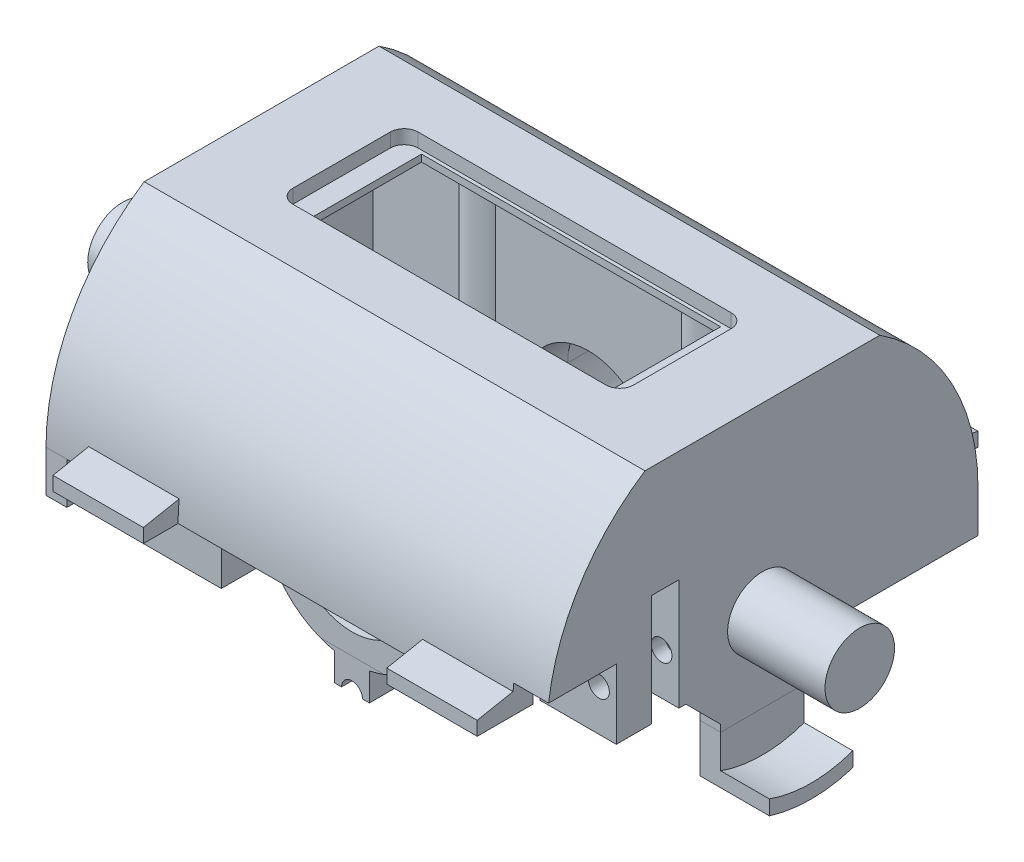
from build123d import *
from build123d.topology import SkipClean

# Parameters (mm, degrees)
BOSS_EXTRUDE1_DEPTH      = 33
BOSS_EXTRUDE2_DEPTH      = 1.5
BOSS_EXTRUDE3_START      = 1.5
BOSS_EXTRUDE3_DEPTH      = 1.5
SKETCH4_R                = 3.5
BOSS_EXTRUDE5_DEPTH      = 8
CUT_EXTRUDE1_DEPTH       = 1
SKETCH6_W                = 21.5
SKETCH6_H                = 8.5
CUT_EXTRUDE2_DEPTH       = 0.5
SKETCH7_R                = 2.5
BOSS_EXTRUDE6_DEPTH      = 3.5
BOSS_EXTRUDE7_DEPTH      = 3.5
BOSS_EXTRUDE8_START      = 7
SKETCH9_R                = 2.5
BOSS_EXTRUDE8_DEPTH      = 7
BOSS_EXTRUDE9_START      = 9
BOSS_EXTRUDE9_DEPTH      = 6.5
BOSS_EXTRUDE10_START     = -15
BOSS_EXTRUDE10_DEPTH     = 6.5
BOSS_EXTRUDE11_REACH     = 62.431
SKETCH12_R               = 1
SKETCH12_W               = 4
SKETCH12_H               = 1
BOSS_EXTRUDE13_START     = 6
SKETCH17_R               = 1
BOSS_EXTRUDE13_DEPTH     = 6
CUT_EXTRUDE3_REACH       = 55.047
CUT_EXTRUDE4_REACH       = 53.613
BOSS_EXTRUDE12_START     = 10
SKETCH15_R               = 1
BOSS_EXTRUDE12_DEPTH     = 10
SKETCH16_R               = 4.5
CUT_EXTRUDE5_DEPTH       = 6
CUT_EXTRUDE6_REACH       = 57.997
SKETCH19_R               = 1
BOSS_EXTRUDE14_DEPTH     = 6
SKETCH20_R               = 4.5
CUT_EXTRUDE7_DEPTH       = 3
BOSS_EXTRUDE15_START     = -4
BOSS_EXTRUDE15_DEPTH     = 7.5
CUT_EXTRUDE9_DEPTH       = 1
CUT_EXTRUDE9_DEPTH_BACK  = 4
SKETCH23_W               = 5
SKETCH23_H               = 6
SKETCH24_W               = 1.5
SKETCH24_H               = 1.984359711
CUT_EXTRUDE10_DEPTH      = 8
CUT_EXTRUDE11_DEPTH      = 5
SKETCH30_W               = 4
SKETCH30_H               = 2.515640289
SKETCH30_H_2             = 1
BOSS_EXTRUDE16_DEPTH     = 3
SKETCH28_R               = 0.75
CUT_EXTRUDE13_DEPTH      = 1.5
CUT_EXTRUDE14_REACH      = 56.074
SKETCH31_R               = 0.75
SKETCH35_W               = 7.5
SKETCH35_H               = 6.5
CUT_EXTRUDE16_DEPTH      = 1
SKETCH36_W               = 10
SKETCH36_H               = 1.5
BOSS_EXTRUDE18_DEPTH     = 1
BOSS_EXTRUDE19_START     = 1
SKETCH37_R               = 1
BOSS_EXTRUDE19_DEPTH     = 1
SKETCH38_W               = 7.6
SKETCH38_H               = 4
BOSS_EXTRUDE20_DEPTH     = 3
SKETCH39_R               = 2
BOSS_EXTRUDE21_DEPTH     = 10
CUT_EXTRUDE17_REACH      = 63.146
CUT_EXTRUDE17_END_RADIUS = 14
SKETCH40_R               = 1
SKETCH40_W               = 4.5
SKETCH40_H               = 4
SKETCH41_R               = 1
SKETCH41_R_2             = 0.72547594
BOSS_EXTRUDE22_DEPTH     = 3


with BuildPart() as part:
    # Sketch1 → Boss-Extrude1 (new body)
    with BuildSketch(Plane(origin=(0, 0, 0), x_dir=(0, 0, -1), z_dir=(1, 0, 0))):
        with BuildLine():
            Line((-32.400990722, 3.183278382), (-15.519047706, 3.183278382))
            ThreePointArc((-15.519047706, 3.183278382), (-10.338619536, -2.420271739), (-8.460019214, -9.816721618))
            Line((-8.460019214, -9.816721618), (-9.960019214, -9.816721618))
            ThreePointArc((-9.960019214, -9.816721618), (-11.554757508, -3.327539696), (-15.975659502, 1.683278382))
            Line((-15.975659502, 1.683278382), (-31.944378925, 1.683278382))
            ThreePointArc((-31.944378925, 1.683278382), (-36.365280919, -3.327539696), (-37.960019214, -9.816721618))
            Line((-37.960019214, -9.816721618), (-39.460019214, -9.816721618))
            ThreePointArc((-39.460019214, -9.816721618), (-37.581418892, -2.420271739), (-32.400990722, 3.183278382))
        make_face()
    extrude(amount=BOSS_EXTRUDE1_DEPTH)

    # Sketch3 → Boss-Extrude3 (add)
    with BuildSketch(Plane.ZY.offset(BOSS_EXTRUDE3_START)):
        with BuildLine():
            Line((15.519047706, 3.183278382), (32.400990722, 3.183278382))
            ThreePointArc((32.400990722, 3.183278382), (37.581418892, -2.420271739), (39.460019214, -9.816721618))
            Line((39.460019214, -9.816721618), (39.460019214, -12.816721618))
            Line((39.460019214, -12.816721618), (8.460019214, -12.816721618))
            Line((8.460019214, -12.816721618), (8.460019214, -9.816721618))
            ThreePointArc((8.460019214, -9.816721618), (10.338619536, -2.420271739), (15.519047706, 3.183278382))
        make_face()
    extrude(amount=-BOSS_EXTRUDE3_DEPTH)

    # Sketch4 → Boss-Extrude5 (add)
    with BuildSketch(Plane.ZY):
        with Locations(Location((23.960019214, -9.816721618, 0), (0, 0, 238.997280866))):
            Circle(SKETCH4_R)
    extrude(amount=BOSS_EXTRUDE5_DEPTH)

    # Sketch5 → Cut-Extrude1 (cut)
    with BuildSketch(Plane(origin=(0, 3.183278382, 0), x_dir=(1, 0, 0), z_dir=(0, 1, 0))):
        with BuildLine():
            Line((27.75, -28.460019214), (5.25, -28.460019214))
            ThreePointArc((5.25, -28.460019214), (4.542893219, -28.167125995), (4.25, -27.460019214))
            Line((4.25, -27.460019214), (4.25, -20.460019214))
            ThreePointArc((4.25, -20.460019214), (4.542893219, -19.752912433), (5.25, -19.460019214))
            Line((5.25, -19.460019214), (27.75, -19.460019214))
            ThreePointArc((27.75, -19.460019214), (28.457106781, -19.752912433), (28.75, -20.460019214))
            Line((28.75, -20.460019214), (28.75, -27.460019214))
            ThreePointArc((28.75, -27.460019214), (28.457106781, -28.167125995), (27.75, -28.460019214))
        make_face()
    extrude(amount=-CUT_EXTRUDE1_DEPTH, mode=Mode.SUBTRACT)

    # Sketch6 → Cut-Extrude2 (cut)
    with BuildSketch(Plane(origin=(0, 2.183278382, 0), x_dir=(1, 0, 0), z_dir=(0, 1, 0))):
        with Locations((16.5, -23.960019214)):
            Rectangle(SKETCH6_W, SKETCH6_H)
    extrude(amount=-CUT_EXTRUDE2_DEPTH, mode=Mode.SUBTRACT)

    # Sketch7 → Boss-Extrude6 (add)
    with BuildSketch(Plane.ZY.offset(8)):
        with Locations((23.960019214, -9.816721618)):
            Circle(SKETCH7_R)
    extrude(amount=BOSS_EXTRUDE6_DEPTH)

    # Sketch10 → Boss-Extrude9 (add)
    with BuildSketch(Plane(origin=(16.5, 0, 0), x_dir=(0, 0, -1), z_dir=(1, 0, 0)).offset(BOSS_EXTRUDE9_START)):
        Polygon((-8.460019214, -9.816721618), (-5.960019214, -9.816721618), (-5.960019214, -8.816721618), (-8.532770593, -8.316721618), align=None)
        Polygon((-41.960019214, -9.816721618), (-41.960019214, -8.816721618), (-39.387267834, -8.316721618), (-39.460019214, -9.816721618), align=None)
    extrude(amount=BOSS_EXTRUDE9_DEPTH)

    # Sketch10_2 → Boss-Extrude10 (add)
    with BuildSketch(Plane(origin=(16.5, 0, 0), x_dir=(0, 0, -1), z_dir=(1, 0, 0)).offset(BOSS_EXTRUDE10_START)):
        Polygon((-8.460019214, -9.816721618), (-5.960019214, -9.816721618), (-5.960019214, -8.816721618), (-8.532770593, -8.316721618), align=None)
        Polygon((-41.960019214, -9.816721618), (-41.960019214, -8.816721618), (-39.387267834, -8.316721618), (-39.460019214, -9.816721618), align=None)
    extrude(amount=BOSS_EXTRUDE10_DEPTH)

    # Sketch12 → Boss-Extrude11 (add, up to next)
    with BuildSketch(Plane(origin=(0, -9.816721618, 0), x_dir=(-1, 0, 0), z_dir=(0, -1, 0)), mode=Mode.PRIVATE) as boss_extrude11_sk1:
        with BuildLine():
            Line((0, -17.460019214), (-6.563508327, -17.460019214))
            ThreePointArc((-6.563508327, -17.460019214), (-7.913373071, -18.872051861), (-9.822875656, -18.460019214))
            Line((-9.822875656, -18.460019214), (-23.177124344, -18.460019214))
            ThreePointArc((-23.177124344, -18.460019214), (-25.086626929, -18.872051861), (-26.436491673, -17.460019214))
            Line((-26.436491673, -17.460019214), (-33, -17.460019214))
            Line((-33, -17.460019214), (-33, -16.460019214))
            Line((-33, -16.460019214), (-26.436491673, -16.460019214))
            ThreePointArc((-26.436491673, -16.460019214), (-25.724744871, -15.378880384), (-24.5, -14.960019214))
            Line((-24.5, -14.960019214), (-24.5, -13.960019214))
            ThreePointArc((-24.5, -13.960019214), (-26.5, -11.960019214), (-24.5, -9.960019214))
            Line((-24.5, -9.960019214), (-8.5, -9.960019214))
            ThreePointArc((-8.5, -9.960019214), (-6.5, -11.960019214), (-8.5, -13.960019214))
            Line((-8.5, -13.960019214), (-8.5, -14.960019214))
            ThreePointArc((-8.5, -14.960019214), (-7.275255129, -15.378880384), (-6.563508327, -16.460019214))
            Line((-6.563508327, -16.460019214), (0, -16.460019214))
            Line((0, -16.460019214), (0, -17.460019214))
        make_face()
        with Locations(Location((-24.5, -16.960019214, 0), (0, 0, 90))):
            Circle(SKETCH12_R, mode=Mode.SUBTRACT)
        with Locations(Location((-8.5, -16.960019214, 0), (0, 0, 79.853233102))):
            Circle(SKETCH12_R, mode=Mode.SUBTRACT)
        with Locations(Location((-24.5, -11.960019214, 0), (0, 0, 90))):
            Circle(SKETCH12_R, mode=Mode.SUBTRACT)
        with Locations(Location((-8.5, -11.960019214, 0), (0, 0, 90))):
            Circle(SKETCH12_R, mode=Mode.SUBTRACT)
        with BuildLine():
            Line((-23.5, -15.227968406), (-23.5, -13.692070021))
            ThreePointArc((-23.5, -13.692070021), (-23.085786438, -13.374232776), (-22.767949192, -12.960019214))
            Line((-22.767949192, -12.960019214), (-10.232050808, -12.960019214))
            ThreePointArc((-10.232050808, -12.960019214), (-9.914213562, -13.374232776), (-9.5, -13.692070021))
            Line((-9.5, -13.692070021), (-9.5, -15.227968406))
            ThreePointArc((-9.5, -15.227968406), (-9.667218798, -15.335950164), (-9.822875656, -15.460019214))
            Line((-9.822875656, -15.460019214), (-23.177124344, -15.460019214))
            ThreePointArc((-23.177124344, -15.460019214), (-23.332781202, -15.335950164), (-23.5, -15.227968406))
        make_face(mode=Mode.SUBTRACT)
    boss_extrude11_tool1 = extrude(boss_extrude11_sk1.sketch, amount=-BOSS_EXTRUDE11_REACH, mode=Mode.PRIVATE) - part.part
    # Sketch12 → Boss-Extrude11 (add, up to next)
    with BuildSketch(Plane(origin=(0, -9.816721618, 0), x_dir=(-1, 0, 0), z_dir=(0, -1, 0)), mode=Mode.PRIVATE) as boss_extrude11_sk2:
        with BuildLine():
            Line((-11.5, -37.960019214), (-10.5, -37.960019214))
            Line((-10.5, -37.960019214), (-10.5, -35.692070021))
            ThreePointArc((-10.5, -35.692070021), (-8.786440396, -35.828396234), (-7.6, -34.584519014))
            Line((-7.6, -34.584519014), (-7.6, -35.960019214))
            Line((-7.6, -35.960019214), (0, -35.960019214))
            Line((0, -35.960019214), (0, -31.960019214))
            Line((0, -31.960019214), (-7.6, -31.960019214))
            Line((-7.6, -31.960019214), (-7.6, -33.335519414))
            ThreePointArc((-7.6, -33.335519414), (-8.975697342, -32.029965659), (-10.822875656, -32.460019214))
            Line((-10.822875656, -32.460019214), (-22.177124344, -32.460019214))
            ThreePointArc((-22.177124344, -32.460019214), (-24.086626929, -32.047986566), (-25.436491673, -33.460019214))
            Line((-25.436491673, -33.460019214), (-29, -33.460019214))
            Line((-29, -33.460019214), (-29, -31.960019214))
            Line((-29, -31.960019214), (-33, -31.960019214))
            Line((-33, -31.960019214), (-33, -33.460019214))
            Line((-33, -33.460019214), (-33, -34.460019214))
            Line((-33, -34.460019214), (-25.436491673, -34.460019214))
            ThreePointArc((-25.436491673, -34.460019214), (-24.27378386, -35.804269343), (-22.5, -35.692070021))
            Line((-22.5, -35.692070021), (-22.5, -37.960019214))
            Line((-22.5, -37.960019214), (-21.5, -37.960019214))
            Line((-21.5, -37.960019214), (-21.5, -35.460019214))
            Line((-21.5, -35.460019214), (-11.5, -35.460019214))
            Line((-11.5, -35.460019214), (-11.5, -37.960019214))
        make_face()
        with Locations(Location((-23.5, -33.960019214, 0), (0, 0, 90))):
            Circle(SKETCH12_R, mode=Mode.SUBTRACT)
        with Locations(Location((-9.5, -33.960019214, 0), (0, 0, 90))):
            Circle(SKETCH12_R, mode=Mode.SUBTRACT)
    boss_extrude11_tool2 = extrude(boss_extrude11_sk2.sketch, amount=-BOSS_EXTRUDE11_REACH, mode=Mode.PRIVATE) - part.part
    # Sketch12 → Boss-Extrude11 (add, up to next)
    with BuildSketch(Plane(origin=(0, -9.816721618, 0), x_dir=(-1, 0, 0), z_dir=(0, -1, 0)), mode=Mode.PRIVATE) as boss_extrude11_sk3:
        with Locations((-31, -29.460019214)):
            Rectangle(SKETCH12_W, SKETCH12_H)
    boss_extrude11_tool3 = extrude(boss_extrude11_sk3.sketch, amount=-BOSS_EXTRUDE11_REACH, mode=Mode.PRIVATE) - part.part


with BuildPart() as body_2:
    # Sketch2 → Boss-Extrude2 (new body)
    with BuildSketch(Plane(origin=(33, 0, 0), x_dir=(0, 0, -1), z_dir=(1, 0, 0))):
        with BuildLine():
            Line((-18.460019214, -12.816721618), (-20.960019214, -15.316721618))
            Line((-20.960019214, -15.316721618), (-20.960019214, -19.269935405))
            ThreePointArc((-20.960019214, -19.269935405), (-23.960019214, -19.734546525), (-26.960019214, -19.269935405))
            Line((-26.960019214, -19.269935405), (-26.960019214, -15.316721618))
            Line((-26.960019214, -15.316721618), (-29.460019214, -12.816721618))
            Line((-29.460019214, -12.816721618), (-39.460019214, -12.816721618))
            Line((-39.460019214, -12.816721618), (-39.460019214, -9.816721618))
            ThreePointArc((-39.460019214, -9.816721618), (-37.581418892, -2.420271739), (-32.400990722, 3.183278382))
            Line((-32.400990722, 3.183278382), (-15.519047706, 3.183278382))
            ThreePointArc((-15.519047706, 3.183278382), (-10.338619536, -2.420271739), (-8.460019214, -9.816721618))
            Line((-8.460019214, -9.816721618), (-8.460019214, -12.816721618))
            Line((-8.460019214, -12.816721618), (-18.460019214, -12.816721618))
        make_face()
    extrude(amount=BOSS_EXTRUDE2_DEPTH)

    # Sketch8 → Boss-Extrude7 (add)
    with BuildSketch(Plane(origin=(34.5, 0, 0), x_dir=(0, 0, -1), z_dir=(1, 0, 0))):
        with BuildLine():
            Line((-20.960019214, -18.214792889), (-20.960019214, -19.269935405))
            ThreePointArc((-20.960019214, -19.269935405), (-23.960019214, -19.734546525), (-26.960019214, -19.269935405))
            Line((-26.960019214, -19.269935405), (-26.960019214, -18.214792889))
            ThreePointArc((-26.960019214, -18.214792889), (-23.960019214, -18.734546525), (-20.960019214, -18.214792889))
        make_face()
    extrude(amount=BOSS_EXTRUDE7_DEPTH)

    # Sketch9 → Boss-Extrude8 (add)
    with BuildSketch(Plane(origin=(34.5, 0, 0), x_dir=(0, 0, -1), z_dir=(1, 0, 0)).offset(BOSS_EXTRUDE8_START)):
        with Locations((-23.960019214, -9.816721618)):
            Circle(SKETCH9_R)
    extrude(amount=-BOSS_EXTRUDE8_DEPTH)


with BuildPart() as part_1:
    add(part.part)

    add(body_2.part)  # Boss-Extrude11 merges body 2
    add(boss_extrude11_tool1.solids().sort_by_distance((3.281754, -9.816722, 16.802072))[0])
    add(boss_extrude11_tool2.solids().sort_by_distance((14.451335, -9.816722, 34.021962))[0])
    add(boss_extrude11_tool3.solids().sort_by_distance((31, -9.816722, 29.460019))[0])

    # Sketch17 → Boss-Extrude13 (add)
    with BuildSketch(Plane.XZ.offset(9.816721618).offset(BOSS_EXTRUDE13_START)):
        with BuildLine():
            Line((24.5, 9.960019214), (8.5, 9.960019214))
            ThreePointArc((8.5, 9.960019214), (7.085786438, 13.374232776), (10.5, 11.960019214))
            Line((10.5, 11.960019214), (22.5, 11.960019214))
            ThreePointArc((22.5, 11.960019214), (25.914213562, 13.374232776), (24.5, 9.960019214))
        make_face()
        with Locations(Location((24.5, 11.960019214, 0), (0, 0, 270))):
            Circle(SKETCH17_R, mode=Mode.SUBTRACT)
        with Locations(Location((8.5, 11.960019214, 0), (0, 0, 270))):
            Circle(SKETCH17_R, mode=Mode.SUBTRACT)
    extrude(amount=-BOSS_EXTRUDE13_DEPTH)

    # Sketch13 → Cut-Extrude3 (cut, up to next)
    with BuildSketch(Plane(origin=(0, 0, 32.460019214), x_dir=(-1, 0, 0), z_dir=(0, 0, -1)), mode=Mode.PRIVATE) as cut_extrude3_sk1:
        with BuildLine():
            Line((-12, -9.816721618), (-21, -9.816721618))
            ThreePointArc((-21, -9.816721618), (-16.5, -5.316721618), (-12, -9.816721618))
        make_face()
    cut_extrude3_tool1 = extrude(cut_extrude3_sk1.sketch, amount=-CUT_EXTRUDE3_REACH, mode=Mode.PRIVATE) & part_1.part
    add(cut_extrude3_tool1.solids().sort_by_distance((16.5, -7.906862, 32.460019))[0], mode=Mode.SUBTRACT)

    # Sketch14 → Cut-Extrude4 (cut, up to next)
    with BuildSketch(Plane.XY.offset(18.460019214), mode=Mode.PRIVATE) as cut_extrude4_sk1:
        with BuildLine():
            Line((21, -9.816721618), (12, -9.816721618))
            ThreePointArc((12, -9.816721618), (16.5, -5.316721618), (21, -9.816721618))
        make_face()
    cut_extrude4_tool1 = extrude(cut_extrude4_sk1.sketch, amount=-CUT_EXTRUDE4_REACH, mode=Mode.PRIVATE) & part_1.part
    add(cut_extrude4_tool1.solids().sort_by_distance((16.5, -7.906862, 18.460019))[0], mode=Mode.SUBTRACT)

    # Sketch15 → Boss-Extrude12 (add)
    with BuildSketch(Plane.XZ.offset(9.816721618).offset(BOSS_EXTRUDE12_START)):
        with BuildLine():
            Line((22.177124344, 32.460019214), (10.822875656, 32.460019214))
            ThreePointArc((10.822875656, 32.460019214), (7.5, 33.960019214), (10.822875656, 35.460019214))
            Line((10.822875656, 35.460019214), (22.177124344, 35.460019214))
            ThreePointArc((22.177124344, 35.460019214), (25.5, 33.960019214), (22.177124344, 32.460019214))
        make_face()
        with Locations(Location((9.5, 33.960019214, 0), (0, 0, 270))):
            Circle(SKETCH15_R, mode=Mode.SUBTRACT)
        with Locations(Location((23.5, 33.960019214, 0), (0, 0, 270))):
            Circle(SKETCH15_R, mode=Mode.SUBTRACT)
    extrude(amount=-BOSS_EXTRUDE12_DEPTH)

    # Sketch16 → Cut-Extrude5 (cut)
    with BuildSketch(Plane.XY.offset(37.960019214)):
        with Locations(Location((16.5, -9.816721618, 0), (0, 0, 180))):
            Circle(SKETCH16_R)
        with BuildLine():
            Line((25.5, -12.816721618), (22.177124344, -12.816721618))
            ThreePointArc((22.177124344, -12.816721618), (20.336115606, -14.965892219), (17.75, -16.114915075))
            Line((17.75, -16.114915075), (17.75, -18.114915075))
            Line((17.75, -18.114915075), (17.25, -18.114915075))
            ThreePointArc((17.25, -18.114915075), (16.5, -17.364915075), (15.75, -18.114915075))
            Line((15.75, -18.114915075), (15.25, -18.114915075))
            Line((15.25, -18.114915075), (15.25, -16.114915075))
            ThreePointArc((15.25, -16.114915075), (12.663884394, -14.965892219), (10.822875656, -12.816721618))
            Line((10.822875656, -12.816721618), (7.5, -12.816721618))
            Line((7.5, -12.816721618), (7.5, -19.816721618))
            Line((7.5, -19.816721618), (25.5, -19.816721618))
            Line((25.5, -19.816721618), (25.5, -12.816721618))
        make_face()
    extrude(amount=-CUT_EXTRUDE5_DEPTH, mode=Mode.SUBTRACT)

    # Sketch18 → Cut-Extrude6 (cut, up to next)
    with BuildSketch(Plane(origin=(0, 0, 9.960019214), x_dir=(-1, 0, 0), z_dir=(0, 0, -1)), mode=Mode.PRIVATE) as cut_extrude6_sk1:
        Polygon((-12.75, -15.816721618), (-12.75, -14.816721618), (-13.5, -14.816721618), (-13.5, -12.316721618), (-19.5, -12.316721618), (-19.5, -14.816721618), (-20.25, -14.816721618), (-20.25, -15.816721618), align=None)
    cut_extrude6_tool1 = extrude(cut_extrude6_sk1.sketch, amount=-CUT_EXTRUDE6_REACH, mode=Mode.PRIVATE) & part_1.part
    add(cut_extrude6_tool1.solids().sort_by_distance((16.5, -14.150055, 9.960019))[0], mode=Mode.SUBTRACT)



with BuildPart() as body_2_2:
    # Sketch19 → Boss-Extrude14 (new body)
    with BuildSketch(Plane.XZ.offset(9.816721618)):
        with BuildLine():
            Line((9.822875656, 18.460019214), (23.177124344, 18.460019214))
            ThreePointArc((23.177124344, 18.460019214), (26.5, 16.960019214), (23.177124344, 15.460019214))
            Line((23.177124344, 15.460019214), (9.822875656, 15.460019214))
            ThreePointArc((9.822875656, 15.460019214), (6.5, 16.960019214), (9.822875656, 18.460019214))
        make_face()
        with Locations(Location((8.5, 16.960019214, 0), (0, 0, 259.853233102))):
            Circle(SKETCH19_R, mode=Mode.SUBTRACT)
        with Locations(Location((24.5, 16.960019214, 0), (0, 0, 270))):
            Circle(SKETCH19_R, mode=Mode.SUBTRACT)
    extrude(amount=BOSS_EXTRUDE14_DEPTH)

    # Sketch20 → Cut-Extrude7 (cut)
    with BuildSketch(Plane.XY.offset(18.460019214)):
        with Locations(Location((16.5, -9.816721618, 0), (0, 0, 180))):
            Circle(SKETCH20_R)
    extrude(amount=-CUT_EXTRUDE7_DEPTH, mode=Mode.SUBTRACT)


with BuildPart() as part_2:
    add(part_1.part)

    add(body_2_2.part)  # Boss-Extrude15 merges body 2 2
    # Sketch21 → Boss-Extrude15 (add)
    with BuildSketch(Plane(origin=(0, 0, 15.460019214), x_dir=(-1, 0, 0), z_dir=(0, 0, -1)).offset(BOSS_EXTRUDE15_START)):
        with BuildLine():
            Line((-19.5, -14.816721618), (-13.5, -14.816721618))
            Line((-13.5, -14.816721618), (-11.5, -12.816721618))
            Line((-11.5, -12.816721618), (-11.5, -6.816721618))
            Line((-11.5, -6.816721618), (-12, -6.816721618))
            Line((-12, -6.816721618), (-12, -9.816721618))
            ThreePointArc((-12, -9.816721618), (-16.5, -14.316721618), (-21, -9.816721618))
            Line((-21, -9.816721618), (-21, -6.816721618))
            Line((-21, -6.816721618), (-21.5, -6.816721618))
            Line((-21.5, -6.816721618), (-21.5, -12.816721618))
            Line((-21.5, -12.816721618), (-19.5, -14.816721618))
        make_face()
    extrude(amount=BOSS_EXTRUDE15_DEPTH)

    # Sketch23 → Cut-Extrude9 (cut, two sides: drawn at the far end of the back side and taken through both)
    with BuildSketch(Plane.XY.offset(18.460019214).offset(-CUT_EXTRUDE9_DEPTH_BACK)):
        with Locations((24, -12.816721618)):
            Rectangle(SKETCH23_W, SKETCH23_H)
        with Locations((9, -12.816721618)):
            Rectangle(SKETCH23_W, SKETCH23_H)
    extrude(amount=CUT_EXTRUDE9_DEPTH + CUT_EXTRUDE9_DEPTH_BACK, mode=Mode.SUBTRACT)

    # Sketch24 → Cut-Extrude10 (cut)
    with BuildSketch(Plane.XZ.offset(12.816721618)):
        with Locations((33.75, 30.95219907)):
            Rectangle(SKETCH24_W, SKETCH24_H)
    extrude(amount=-CUT_EXTRUDE10_DEPTH, mode=Mode.SUBTRACT)

    # Sketch26 → Cut-Extrude11 (cut)
    with BuildSketch(Plane.XZ.offset(12.816721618)):
        Polygon((33, 39.460019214), (34.5, 39.460019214), (34.5, 34.460019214), (32, 34.460019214), (32, 37.960019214), (32, 39.460019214), align=None)
    extrude(amount=-CUT_EXTRUDE11_DEPTH, mode=Mode.SUBTRACT)

    # Sketch30 → Boss-Extrude16 (add)
    with BuildSketch(Plane.XZ.offset(9.816721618)):
        with Locations((31, 33.202199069)):
            Rectangle(SKETCH30_W, SKETCH30_H)
        with Locations((31, 29.460019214)):
            Rectangle(SKETCH30_W, SKETCH30_H_2)
    extrude(amount=BOSS_EXTRUDE16_DEPTH)

    # Sketch28 → Cut-Extrude13 (cut)
    with BuildSketch(Plane.ZY.offset(1.5)):
        with Locations((14.960019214, -9.816721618)):
            Circle(SKETCH28_R)
        with Locations((28.460019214, -9.816721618)):
            Circle(SKETCH28_R)
    extrude(amount=-CUT_EXTRUDE13_DEPTH, mode=Mode.SUBTRACT)

    # Cut-Extrude14: up to this face of the body (flat: up to its plane)
    cut_extrude14_end = Plane(part_2.part.faces().sort_by_distance((31, -5.566721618, 28.960019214))[0])
    # Sketch31 → Cut-Extrude14 (cut, up to the picked face)
    with BuildSketch(Plane.XY.offset(34.460019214), mode=Mode.PRIVATE) as cut_extrude14_sk1:
        with Locations((33.25, -9.816721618)):
            Circle(SKETCH31_R)
    cut_extrude14_tool1 = split(extrude(cut_extrude14_sk1.sketch, amount=-CUT_EXTRUDE14_REACH, mode=Mode.PRIVATE), bisect_by=cut_extrude14_end, keep=Keep.BOTH, mode=Mode.PRIVATE)
    add(cut_extrude14_tool1.solids().sort_by(Axis((33.25, -9.816722, 34.460019), (0, 0, -1)))[0], mode=Mode.SUBTRACT)

    # Sketch35 → Cut-Extrude16 (cut)
    with BuildSketch(Plane.XZ.offset(15.816721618)):
        with Locations((16.5, 15.210019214)):
            Rectangle(SKETCH35_W, SKETCH35_H)
    extrude(amount=-CUT_EXTRUDE16_DEPTH, mode=Mode.SUBTRACT)

    # Sketch36 → Boss-Extrude18 (add)
    with BuildSketch(Plane.XZ.offset(15.816721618)):
        with Locations((16.5, 17.710019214)):
            Rectangle(SKETCH36_W, SKETCH36_H)
    extrude(amount=BOSS_EXTRUDE18_DEPTH)

    # Sketch37 → Boss-Extrude19 (add)
    with BuildSketch(Plane.XZ.offset(15.816721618).offset(BOSS_EXTRUDE19_START)):
        with BuildLine():
            Line((24.5, 9.960019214), (8.5, 9.960019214))
            ThreePointArc((8.5, 9.960019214), (7.085786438, 13.374232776), (10.5, 11.960019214))
            Line((10.5, 11.960019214), (22.5, 11.960019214))
            ThreePointArc((22.5, 11.960019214), (25.914213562, 13.374232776), (24.5, 9.960019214))
        make_face()
        with Locations(Location((24.5, 11.960019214, 0), (0, 0, 270))):
            Circle(SKETCH37_R, mode=Mode.SUBTRACT)
        with Locations(Location((8.5, 11.960019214, 0), (0, 0, 270))):
            Circle(SKETCH37_R, mode=Mode.SUBTRACT)
    extrude(amount=-BOSS_EXTRUDE19_DEPTH)


with BuildPart() as body_2_3:
    # Split1: the piece on the far side of the plane
    add(part_2.part)
    split(bisect_by=Plane.ZX.offset(-15.816721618), keep=Keep.BOTTOM)


with BuildPart() as part_3:
    add(part_2.part)

    # Split1
    split(bisect_by=Plane.ZX.offset(-15.816721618), keep=Keep.TOP)

    # Sketch38 → Boss-Extrude20 (add)
    with BuildSketch(Plane.XZ.offset(9.816721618)):
        with Locations((3.8, 33.960019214)):
            Rectangle(SKETCH38_W, SKETCH38_H)
    extrude(amount=BOSS_EXTRUDE20_DEPTH)

    # Sketch39 → Boss-Extrude21 (add)
    with BuildSketch(Plane.XZ.offset(12.816721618)):
        with Locations((0, 33.960019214)):
            Circle(SKETCH39_R)
    extrude(amount=-BOSS_EXTRUDE21_DEPTH)

    # Cut-Extrude17: up to this cylinder (the profile starts inside it)
    with SkipClean():  # the faces are left unmerged after this step: merging them gives an invalid solid
        cut_extrude17_end = Plane(origin=(1.925, -9.816721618, 23.960019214), z_dir=(-1, 0, 0)) * Cylinder(CUT_EXTRUDE17_END_RADIUS, 159.142, mode=Mode.PRIVATE)
        # Sketch40 → Cut-Extrude17 (cut, up to the surface)
        with BuildSketch(Plane.XZ.offset(12.816721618), mode=Mode.PRIVATE) as cut_extrude17_sk1:
            with Locations(Location((0, 33.960019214, 0), (0, 0, 270))):
                Circle(SKETCH40_R)
        cut_extrude17_tool1 = extrude(cut_extrude17_sk1.sketch, amount=-CUT_EXTRUDE17_REACH, mode=Mode.PRIVATE) & cut_extrude17_end
        add(cut_extrude17_tool1.solids().sort_by_distance((0, -12.816722, 33.960019))[0], mode=Mode.SUBTRACT)
        # Sketch40 → Cut-Extrude17 (cut, up to the surface)
        with BuildSketch(Plane.XZ.offset(12.816721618), mode=Mode.PRIVATE) as cut_extrude17_sk2:
            with Locations((3.85, 33.960019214)):
                Rectangle(SKETCH40_W, SKETCH40_H)
        cut_extrude17_tool2 = extrude(cut_extrude17_sk2.sketch, amount=-CUT_EXTRUDE17_REACH, mode=Mode.PRIVATE) & cut_extrude17_end
        add(cut_extrude17_tool2.solids().sort_by_distance((3.85, -12.816722, 33.960019))[0], mode=Mode.SUBTRACT)


with BuildPart() as body_3:
    # Sketch41 → Boss-Extrude22 (new body)
    with BuildSketch(Plane.XZ.offset(12.816721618)):
        with BuildLine():
            Line((7.6, 31.960019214), (0, 31.960019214))
            ThreePointArc((0, 31.960019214), (-2, 33.960019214), (0, 35.960019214))
            Line((0, 35.960019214), (7.6, 35.960019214))
            Line((7.6, 35.960019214), (7.6, 31.960019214))
        make_face()
        with Locations(Location((0, 33.960019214, 0), (0, 0, 270))):
            Circle(SKETCH41_R, mode=Mode.SUBTRACT)
        with Locations(Location((3.85, 33.960019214, 0), (0, 0, 270))):
            Circle(SKETCH41_R_2, mode=Mode.SUBTRACT)
    extrude(amount=BOSS_EXTRUDE22_DEPTH)


solid = Compound([body_2_3.part, part_3.part, body_3.part])
